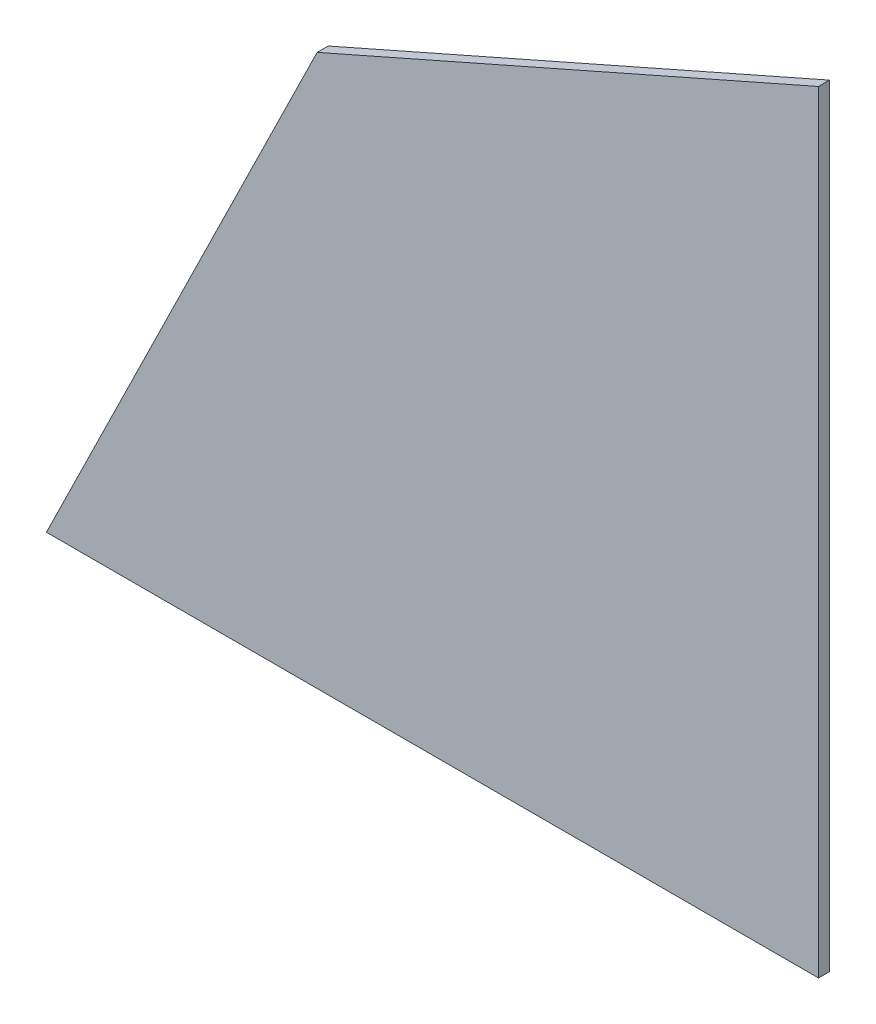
ISO-10303-21;
HEADER;
FILE_DESCRIPTION(('STEP AP214'),'2;1');
FILE_NAME('part.step','',(''),(''),'','','');
FILE_SCHEMA(('AUTOMOTIVE_DESIGN { 1 0 10303 214 1 1 1 1 }'));
ENDSEC;
DATA;
#1=APPLICATION_CONTEXT('core data for automotive mechanical design processes');
#2=APPLICATION_PROTOCOL_DEFINITION('international standard','automotive_design',2000,#1);
#3=PRODUCT_CONTEXT('',#1,'mechanical');
#4=PRODUCT('Part','Part','',(#3));
#5=PRODUCT_RELATED_PRODUCT_CATEGORY('part','',(#4));
#6=PRODUCT_DEFINITION_FORMATION('','',#4);
#7=PRODUCT_DEFINITION_CONTEXT('part definition',#1,'design');
#8=PRODUCT_DEFINITION('design','',#6,#7);
#9=PRODUCT_DEFINITION_SHAPE('','',#8);
#10=(LENGTH_UNIT() NAMED_UNIT(*) SI_UNIT(.MILLI.,.METRE.));
#11=(NAMED_UNIT(*) PLANE_ANGLE_UNIT() SI_UNIT($,.RADIAN.));
#12=(NAMED_UNIT(*) SI_UNIT($,.STERADIAN.) SOLID_ANGLE_UNIT());
#13=UNCERTAINTY_MEASURE_WITH_UNIT(LENGTH_MEASURE(1.E-05),#10,'distance_accuracy_value','');
#14=(GEOMETRIC_REPRESENTATION_CONTEXT(3) GLOBAL_UNCERTAINTY_ASSIGNED_CONTEXT((#13)) GLOBAL_UNIT_ASSIGNED_CONTEXT((#10,
#11,#12)) REPRESENTATION_CONTEXT('',''));
#15=CARTESIAN_POINT('',(0.,0.,0.));
#16=DIRECTION('',(0.,0.,1.));
#17=DIRECTION('',(1.,0.,0.));
#18=AXIS2_PLACEMENT_3D('',#15,#16,#17);
#19=CARTESIAN_POINT('',(-35.,0.,1.));
#20=DIRECTION('',(0.897502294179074,-0.441009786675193,0.));
#21=DIRECTION('',(-0.441009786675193,-0.897502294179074,0.));
#22=AXIS2_PLACEMENT_3D('',#19,#20,#21);
#23=PLANE('',#22);
#24=CARTESIAN_POINT('',(-10.4558411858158,49.95,0.));
#25=DIRECTION('',(0.,0.,1.));
#26=VECTOR('',#25,1.);
#27=LINE('',#24,#26);
#28=CARTESIAN_POINT('',(-10.4558411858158,49.95,0.));
#29=VERTEX_POINT('',#28);
#30=CARTESIAN_POINT('',(-10.4558411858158,49.95,1.));
#31=VERTEX_POINT('',#30);
#32=EDGE_CURVE('E13',#29,#31,#27,.T.);
#33=ORIENTED_EDGE('',*,*,#32,.F.);
#34=CARTESIAN_POINT('',(-10.4558411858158,49.95,0.));
#35=DIRECTION('',(-0.441009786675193,-0.897502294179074,0.));
#36=VECTOR('',#35,1.);
#37=LINE('',#34,#36);
#38=CARTESIAN_POINT('',(-35.,0.,0.));
#39=VERTEX_POINT('',#38);
#40=EDGE_CURVE('E233',#29,#39,#37,.T.);
#41=ORIENTED_EDGE('',*,*,#40,.T.);
#42=CARTESIAN_POINT('',(-35.,0.,0.));
#43=DIRECTION('',(0.,0.,1.));
#44=VECTOR('',#43,1.);
#45=LINE('',#42,#44);
#46=CARTESIAN_POINT('',(-35.,0.,1.));
#47=VERTEX_POINT('',#46);
#48=EDGE_CURVE('E74',#39,#47,#45,.T.);
#49=ORIENTED_EDGE('',*,*,#48,.T.);
#50=CARTESIAN_POINT('',(-10.4558411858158,49.95,1.));
#51=CARTESIAN_POINT('',(-11.4785144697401,47.86875,1.));
#52=CARTESIAN_POINT('',(-12.5011877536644,45.7875,1.));
#53=CARTESIAN_POINT('',(-14.5465343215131,41.625,1.));
#54=CARTESIAN_POINT('',(-15.5692076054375,39.54375,1.));
#55=CARTESIAN_POINT('',(-17.6145541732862,35.38125,1.));
#56=CARTESIAN_POINT('',(-18.6372274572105,33.3,1.));
#57=CARTESIAN_POINT('',(-20.6825740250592,29.1375,1.));
#58=CARTESIAN_POINT('',(-21.7052473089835,27.05625,1.));
#59=CARTESIAN_POINT('',(-23.7505938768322,22.89375,1.));
#60=CARTESIAN_POINT('',(-24.7732671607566,20.8125,1.));
#61=CARTESIAN_POINT('',(-26.8186137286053,16.65,1.));
#62=CARTESIAN_POINT('',(-27.8412870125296,14.56875,1.));
#63=CARTESIAN_POINT('',(-29.8866335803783,10.40625,1.));
#64=CARTESIAN_POINT('',(-30.9093068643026,8.325,1.));
#65=CARTESIAN_POINT('',(-32.9546534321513,4.16249999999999,1.));
#66=CARTESIAN_POINT('',(-33.9773267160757,2.08124999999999,1.));
#67=CARTESIAN_POINT('',(-35.,0.,1.));
#68=B_SPLINE_CURVE_WITH_KNOTS('',3,(#50,#51,#52,#53,#54,#55,#56,#57,#58,#59,#60,#61,#62,#63,#64,
#65,#66,#67),.UNSPECIFIED.,.F.,.F.,(4,2,2,2,2,2,2,2,4),(0.,6.95680672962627,13.9136134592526,
20.8704201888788,27.8272269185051,34.7840336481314,41.7408403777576,48.6976471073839,
55.6544538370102),.UNSPECIFIED.);
#69=EDGE_CURVE('E128',#31,#47,#68,.T.);
#70=ORIENTED_EDGE('',*,*,#69,.F.);
#71=EDGE_LOOP('',(#33,#41,#49,#70));
#72=FACE_BOUND('',#71,.T.);
#73=ADVANCED_FACE('F61',(#72),#23,.F.);
#74=CARTESIAN_POINT('',(35.,0.,1.));
#75=DIRECTION('',(0.,1.,0.));
#76=DIRECTION('',(1.,0.,0.));
#77=AXIS2_PLACEMENT_3D('',#74,#75,#76);
#78=PLANE('',#77);
#79=ORIENTED_EDGE('',*,*,#48,.F.);
#80=CARTESIAN_POINT('',(-35.,0.,0.));
#81=DIRECTION('',(1.,0.,0.));
#82=VECTOR('',#81,1.);
#83=LINE('',#80,#82);
#84=CARTESIAN_POINT('',(35.,0.,0.));
#85=VERTEX_POINT('',#84);
#86=EDGE_CURVE('E110',#39,#85,#83,.T.);
#87=ORIENTED_EDGE('',*,*,#86,.T.);
#88=CARTESIAN_POINT('',(35.,0.,0.));
#89=DIRECTION('',(0.,0.,1.));
#90=VECTOR('',#89,1.);
#91=LINE('',#88,#90);
#92=CARTESIAN_POINT('',(35.,0.,1.));
#93=VERTEX_POINT('',#92);
#94=EDGE_CURVE('E104',#85,#93,#91,.T.);
#95=ORIENTED_EDGE('',*,*,#94,.T.);
#96=CARTESIAN_POINT('',(-35.,0.,1.));
#97=CARTESIAN_POINT('',(-32.0833333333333,0.,1.));
#98=CARTESIAN_POINT('',(-29.1666666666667,0.,1.));
#99=CARTESIAN_POINT('',(-23.3333333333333,0.,1.));
#100=CARTESIAN_POINT('',(-20.4166666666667,0.,1.));
#101=CARTESIAN_POINT('',(-14.5833333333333,0.,1.));
#102=CARTESIAN_POINT('',(-11.6666666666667,0.,1.));
#103=CARTESIAN_POINT('',(-5.83333333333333,0.,1.));
#104=CARTESIAN_POINT('',(-2.91666666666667,0.,1.));
#105=CARTESIAN_POINT('',(2.91666666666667,0.,1.));
#106=CARTESIAN_POINT('',(5.83333333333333,0.,1.));
#107=CARTESIAN_POINT('',(11.6666666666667,0.,1.));
#108=CARTESIAN_POINT('',(14.5833333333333,0.,1.));
#109=CARTESIAN_POINT('',(20.4166666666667,0.,1.));
#110=CARTESIAN_POINT('',(23.3333333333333,0.,1.));
#111=CARTESIAN_POINT('',(29.1666666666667,0.,1.));
#112=CARTESIAN_POINT('',(32.0833333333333,0.,1.));
#113=CARTESIAN_POINT('',(35.,0.,1.));
#114=B_SPLINE_CURVE_WITH_KNOTS('',3,(#96,#97,#98,#99,#100,#101,#102,#103,#104,#105,#106,#107,
#108,#109,#110,#111,#112,#113),.UNSPECIFIED.,.F.,.F.,(4,2,2,2,2,2,2,2,4),(0.,8.75,17.5,26.25,
35.,43.75,52.5,61.25,70.),.UNSPECIFIED.);
#115=EDGE_CURVE('E108',#47,#93,#114,.T.);
#116=ORIENTED_EDGE('',*,*,#115,.F.);
#117=EDGE_LOOP('',(#79,#87,#95,#116));
#118=FACE_BOUND('',#117,.T.);
#119=ADVANCED_FACE('F107',(#118),#78,.F.);
#120=CARTESIAN_POINT('',(35.,0.,1.));
#121=DIRECTION('',(1.,0.,0.));
#122=DIRECTION('',(0.,1.,0.));
#123=AXIS2_PLACEMENT_3D('',#120,#121,#122);
#124=PLANE('',#123);
#125=ORIENTED_EDGE('',*,*,#94,.F.);
#126=CARTESIAN_POINT('',(35.,0.,0.));
#127=DIRECTION('',(0.,1.,0.));
#128=VECTOR('',#127,1.);
#129=LINE('',#126,#128);
#130=CARTESIAN_POINT('',(35.,70.,0.));
#131=VERTEX_POINT('',#130);
#132=EDGE_CURVE('E131',#85,#131,#129,.T.);
#133=ORIENTED_EDGE('',*,*,#132,.T.);
#134=CARTESIAN_POINT('',(35.,70.,0.));
#135=DIRECTION('',(0.,0.,1.));
#136=VECTOR('',#135,1.);
#137=LINE('',#134,#136);
#138=CARTESIAN_POINT('',(35.,70.,1.));
#139=VERTEX_POINT('',#138);
#140=EDGE_CURVE('E118',#131,#139,#137,.T.);
#141=ORIENTED_EDGE('',*,*,#140,.T.);
#142=CARTESIAN_POINT('',(35.,0.,1.));
#143=CARTESIAN_POINT('',(35.,2.91666666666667,1.));
#144=CARTESIAN_POINT('',(35.,5.83333333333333,1.));
#145=CARTESIAN_POINT('',(35.,11.6666666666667,1.));
#146=CARTESIAN_POINT('',(35.,14.5833333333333,1.));
#147=CARTESIAN_POINT('',(35.,20.4166666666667,1.));
#148=CARTESIAN_POINT('',(35.,23.3333333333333,1.));
#149=CARTESIAN_POINT('',(35.,29.1666666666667,1.));
#150=CARTESIAN_POINT('',(35.,32.0833333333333,1.));
#151=CARTESIAN_POINT('',(35.,37.9166666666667,1.));
#152=CARTESIAN_POINT('',(35.,40.8333333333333,1.));
#153=CARTESIAN_POINT('',(35.,46.6666666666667,1.));
#154=CARTESIAN_POINT('',(35.,49.5833333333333,1.));
#155=CARTESIAN_POINT('',(35.,55.4166666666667,1.));
#156=CARTESIAN_POINT('',(35.,58.3333333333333,1.));
#157=CARTESIAN_POINT('',(35.,64.1666666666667,1.));
#158=CARTESIAN_POINT('',(35.,67.0833333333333,1.));
#159=CARTESIAN_POINT('',(35.,70.,1.));
#160=B_SPLINE_CURVE_WITH_KNOTS('',3,(#142,#143,#144,#145,#146,#147,#148,#149,#150,#151,#152,
#153,#154,#155,#156,#157,#158,#159),.UNSPECIFIED.,.F.,.F.,(4,2,2,2,2,2,2,2,4),(0.,8.75,17.5,
26.25,35.,43.75,52.5,61.25,70.),.UNSPECIFIED.);
#161=EDGE_CURVE('E126',#93,#139,#160,.T.);
#162=ORIENTED_EDGE('',*,*,#161,.F.);
#163=EDGE_LOOP('',(#125,#133,#141,#162));
#164=FACE_BOUND('',#163,.T.);
#165=ADVANCED_FACE('F136',(#164),#124,.T.);
#166=CARTESIAN_POINT('',(35.,70.,1.));
#167=DIRECTION('',(-0.403572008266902,0.914947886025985,0.));
#168=DIRECTION('',(-0.914947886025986,-0.403572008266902,0.));
#169=AXIS2_PLACEMENT_3D('',#166,#167,#168);
#170=PLANE('',#169);
#171=CARTESIAN_POINT('',(35.,70.,0.));
#172=DIRECTION('',(-0.914947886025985,-0.403572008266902,0.));
#173=VECTOR('',#172,1.);
#174=LINE('',#171,#173);
#175=EDGE_CURVE('E220',#131,#29,#174,.T.);
#176=ORIENTED_EDGE('',*,*,#175,.T.);
#177=ORIENTED_EDGE('',*,*,#32,.T.);
#178=CARTESIAN_POINT('',(35.,70.,1.));
#179=CARTESIAN_POINT('',(33.1060066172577,69.1645833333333,1.));
#180=CARTESIAN_POINT('',(31.2120132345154,68.3291666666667,1.));
#181=CARTESIAN_POINT('',(27.4240264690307,66.6583333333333,1.));
#182=CARTESIAN_POINT('',(25.5300330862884,65.8229166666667,1.));
#183=CARTESIAN_POINT('',(21.7420463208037,64.1520833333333,1.));
#184=CARTESIAN_POINT('',(19.8480529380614,63.3166666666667,1.));
#185=CARTESIAN_POINT('',(16.0600661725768,61.6458333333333,1.));
#186=CARTESIAN_POINT('',(14.1660727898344,60.8104166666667,1.));
#187=CARTESIAN_POINT('',(10.3780860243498,59.1395833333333,1.));
#188=CARTESIAN_POINT('',(8.48409264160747,58.3041666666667,1.));
#189=CARTESIAN_POINT('',(4.69610587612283,56.6333333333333,1.));
#190=CARTESIAN_POINT('',(2.8021124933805,55.7979166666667,1.));
#191=CARTESIAN_POINT('',(-0.985874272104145,54.1270833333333,1.));
#192=CARTESIAN_POINT('',(-2.87986765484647,53.2916666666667,1.));
#193=CARTESIAN_POINT('',(-6.66785442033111,51.6208333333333,1.));
#194=CARTESIAN_POINT('',(-8.56184780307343,50.7854166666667,1.));
#195=CARTESIAN_POINT('',(-10.4558411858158,49.95,1.));
#196=B_SPLINE_CURVE_WITH_KNOTS('',3,(#178,#179,#180,#181,#182,#183,#184,#185,#186,#187,#188,
#189,#190,#191,#192,#193,#194,#195),.UNSPECIFIED.,.F.,.F.,(4,2,2,2,2,2,2,2,4),(0.,
6.2101680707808,12.4203361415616,18.6305042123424,24.8406722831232,31.050840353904,
37.2610084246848,43.4711764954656,49.6813445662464),.UNSPECIFIED.);
#197=EDGE_CURVE('E140',#139,#31,#196,.T.);
#198=ORIENTED_EDGE('',*,*,#197,.F.);
#199=ORIENTED_EDGE('',*,*,#140,.F.);
#200=EDGE_LOOP('',(#176,#177,#198,#199));
#201=FACE_BOUND('',#200,.T.);
#202=ADVANCED_FACE('F158',(#201),#170,.T.);
#203=CARTESIAN_POINT('',(35.,0.,0.));
#204=CARTESIAN_POINT('',(11.6666666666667,0.,0.));
#205=CARTESIAN_POINT('',(-11.6666666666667,0.,0.));
#206=CARTESIAN_POINT('',(-35.,0.,0.));
#207=CARTESIAN_POINT('',(35.,23.3333333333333,0.));
#208=CARTESIAN_POINT('',(14.3937954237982,21.1055555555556,0.));
#209=CARTESIAN_POINT('',(-6.2124091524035,18.8777777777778,0.));
#210=CARTESIAN_POINT('',(-26.8186137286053,16.65,0.));
#211=CARTESIAN_POINT('',(35.,46.6666666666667,0.));
#212=CARTESIAN_POINT('',(17.1209241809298,42.2111111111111,0.));
#213=CARTESIAN_POINT('',(-0.75815163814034,37.7555555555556,0.));
#214=CARTESIAN_POINT('',(-18.6372274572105,33.3,0.));
#215=CARTESIAN_POINT('',(35.,70.,0.));
#216=CARTESIAN_POINT('',(19.8480529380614,63.3166666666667,0.));
#217=CARTESIAN_POINT('',(4.69610587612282,56.6333333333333,0.));
#218=CARTESIAN_POINT('',(-10.4558411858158,49.95,0.));
#219=B_SPLINE_SURFACE_WITH_KNOTS('',3,3,((#203,#204,#205,#206),(#207,#208,#209,#210),(#211,#212,
#213,#214),(#215,#216,#217,#218)),.UNSPECIFIED.,.F.,.F.,.F.,(4,4),(4,4),(0.,1.),(0.,1.),.UNSPECIFIED.);
#220=OFFSET_SURFACE('',#219,1.,.F.);
#221=ORIENTED_EDGE('',*,*,#161,.T.);
#222=ORIENTED_EDGE('',*,*,#197,.T.);
#223=ORIENTED_EDGE('',*,*,#69,.T.);
#224=ORIENTED_EDGE('',*,*,#115,.T.);
#225=EDGE_LOOP('',(#221,#222,#223,#224));
#226=FACE_BOUND('',#225,.T.);
#227=ADVANCED_FACE('F124',(#226),#220,.T.);
#228=CARTESIAN_POINT('',(35.,0.,0.));
#229=DIRECTION('',(0.,0.,1.));
#230=DIRECTION('',(0.,1.,0.));
#231=AXIS2_PLACEMENT_3D('',#228,#229,#230);
#232=PLANE('',#231);
#233=ORIENTED_EDGE('',*,*,#132,.F.);
#234=ORIENTED_EDGE('',*,*,#86,.F.);
#235=ORIENTED_EDGE('',*,*,#40,.F.);
#236=ORIENTED_EDGE('',*,*,#175,.F.);
#237=EDGE_LOOP('',(#233,#234,#235,#236));
#238=FACE_BOUND('',#237,.T.);
#239=ADVANCED_FACE('F63',(#238),#232,.F.);
#240=CLOSED_SHELL('',(#73,#119,#165,#202,#227,#239));
#241=MANIFOLD_SOLID_BREP('B2',#240);
#242=ADVANCED_BREP_SHAPE_REPRESENTATION('',(#18,#241),#14);
#243=SHAPE_DEFINITION_REPRESENTATION(#9,#242);
ENDSEC;
END-ISO-10303-21;
